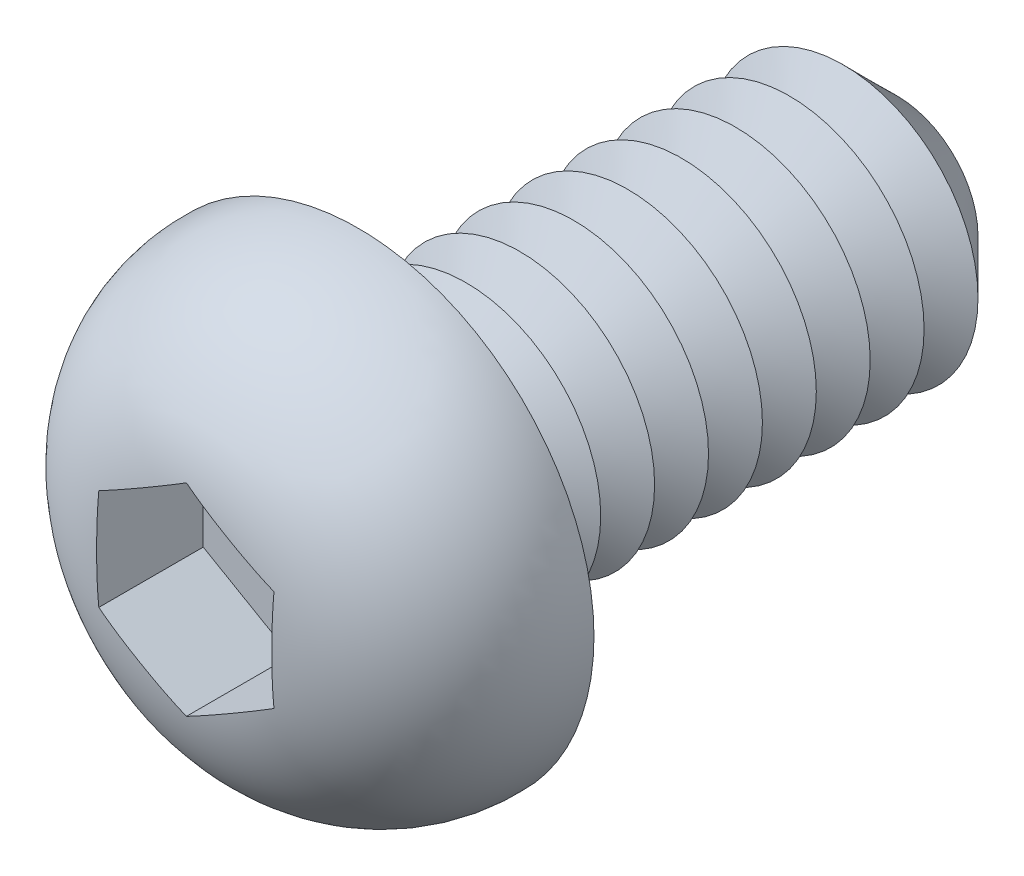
ISO-10303-21;
HEADER;
FILE_DESCRIPTION(('STEP AP214'),'2;1');
FILE_NAME('part.step','',(''),(''),'','','');
FILE_SCHEMA(('AUTOMOTIVE_DESIGN { 1 0 10303 214 1 1 1 1 }'));
ENDSEC;
DATA;
#1=APPLICATION_CONTEXT('core data for automotive mechanical design processes');
#2=APPLICATION_PROTOCOL_DEFINITION('international standard','automotive_design',2000,#1);
#3=PRODUCT_CONTEXT('',#1,'mechanical');
#4=PRODUCT('Part','Part','',(#3));
#5=PRODUCT_RELATED_PRODUCT_CATEGORY('part','',(#4));
#6=PRODUCT_DEFINITION_FORMATION('','',#4);
#7=PRODUCT_DEFINITION_CONTEXT('part definition',#1,'design');
#8=PRODUCT_DEFINITION('design','',#6,#7);
#9=PRODUCT_DEFINITION_SHAPE('','',#8);
#10=(LENGTH_UNIT() NAMED_UNIT(*) SI_UNIT(.MILLI.,.METRE.));
#11=(NAMED_UNIT(*) PLANE_ANGLE_UNIT() SI_UNIT($,.RADIAN.));
#12=(NAMED_UNIT(*) SI_UNIT($,.STERADIAN.) SOLID_ANGLE_UNIT());
#13=UNCERTAINTY_MEASURE_WITH_UNIT(LENGTH_MEASURE(1.E-05),#10,'distance_accuracy_value','');
#14=(GEOMETRIC_REPRESENTATION_CONTEXT(3) GLOBAL_UNCERTAINTY_ASSIGNED_CONTEXT((#13)) GLOBAL_UNIT_ASSIGNED_CONTEXT((#10,
#11,#12)) REPRESENTATION_CONTEXT('',''));
#15=CARTESIAN_POINT('',(0.,0.,0.));
#16=DIRECTION('',(0.,0.,1.));
#17=DIRECTION('',(1.,0.,0.));
#18=AXIS2_PLACEMENT_3D('',#15,#16,#17);
#19=CARTESIAN_POINT('',(0.,0.,-4.));
#20=DIRECTION('',(0.,0.,1.));
#21=DIRECTION('',(1.,0.,0.));
#22=AXIS2_PLACEMENT_3D('',#19,#20,#21);
#23=CYLINDRICAL_SURFACE('',#22,1.);
#24=CARTESIAN_POINT('',(0.,0.,-0.2));
#25=DIRECTION('',(0.,0.,1.));
#26=DIRECTION('',(1.,0.,0.));
#27=AXIS2_PLACEMENT_3D('',#24,#25,#26);
#28=CIRCLE('',#27,1.);
#29=CARTESIAN_POINT('',(1.,0.,-0.2));
#30=VERTEX_POINT('',#29);
#31=EDGE_CURVE('E48',#30,#30,#28,.F.);
#32=ORIENTED_EDGE('',*,*,#31,.T.);
#33=EDGE_LOOP('',(#32));
#34=FACE_BOUND('',#33,.T.);
#35=CARTESIAN_POINT('',(0.,0.,-0.399999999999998));
#36=DIRECTION('',(0.,0.,1.));
#37=DIRECTION('',(1.,0.,0.));
#38=AXIS2_PLACEMENT_3D('',#35,#36,#37);
#39=CIRCLE('',#38,1.);
#40=CARTESIAN_POINT('',(1.,0.,-0.399999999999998));
#41=VERTEX_POINT('',#40);
#42=EDGE_CURVE('E118',#41,#41,#39,.T.);
#43=ORIENTED_EDGE('',*,*,#42,.T.);
#44=EDGE_LOOP('',(#43));
#45=FACE_BOUND('',#44,.T.);
#46=ADVANCED_FACE('F39',(#34,#45),#23,.T.);
#47=CARTESIAN_POINT('',(0.,1.75,0.));
#48=DIRECTION('',(0.,0.,1.));
#49=DIRECTION('',(1.,0.,0.));
#50=AXIS2_PLACEMENT_3D('',#47,#48,#49);
#51=PLANE('',#50);
#52=CARTESIAN_POINT('',(0.,0.,0.));
#53=DIRECTION('',(0.,0.,1.));
#54=DIRECTION('',(1.,0.,0.));
#55=AXIS2_PLACEMENT_3D('',#52,#53,#54);
#56=CIRCLE('',#55,1.2);
#57=CARTESIAN_POINT('',(1.2,0.,0.));
#58=VERTEX_POINT('',#57);
#59=EDGE_CURVE('E11',#58,#58,#56,.T.);
#60=ORIENTED_EDGE('',*,*,#59,.T.);
#61=EDGE_LOOP('',(#60));
#62=FACE_BOUND('',#61,.T.);
#63=CARTESIAN_POINT('',(0.,0.,0.));
#64=DIRECTION('',(0.,0.,1.));
#65=DIRECTION('',(1.,0.,0.));
#66=AXIS2_PLACEMENT_3D('',#63,#64,#65);
#67=CIRCLE('',#66,1.75);
#68=CARTESIAN_POINT('',(1.75,0.,0.));
#69=VERTEX_POINT('',#68);
#70=EDGE_CURVE('E142',#69,#69,#67,.T.);
#71=ORIENTED_EDGE('',*,*,#70,.F.);
#72=EDGE_LOOP('',(#71));
#73=FACE_BOUND('',#72,.T.);
#74=ADVANCED_FACE('F218',(#62,#73),#51,.F.);
#75=CARTESIAN_POINT('',(0.,0.,0.0499999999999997));
#76=DIRECTION('',(0.,0.,1.));
#77=DIRECTION('',(1.,0.,0.));
#78=AXIS2_PLACEMENT_3D('',#75,#76,#77);
#79=DEGENERATE_TOROIDAL_SURFACE('',#78,0.50100040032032,1.25,.T.);
#80=CARTESIAN_POINT('',(-0.6502,0.375162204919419,1.2748120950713));
#81=CARTESIAN_POINT('',(-0.623166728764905,0.390769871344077,1.27799168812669));
#82=CARTESIAN_POINT('',(-0.596087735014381,0.406403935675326,1.28057383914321));
#83=CARTESIAN_POINT('',(-0.541883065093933,0.437699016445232,1.28476453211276));
#84=CARTESIAN_POINT('',(-0.514757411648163,0.453360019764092,1.28637345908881));
#85=CARTESIAN_POINT('',(-0.460533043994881,0.484666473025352,1.288838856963));
#86=CARTESIAN_POINT('',(-0.433434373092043,0.500311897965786,1.28969671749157));
#87=CARTESIAN_POINT('',(-0.379223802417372,0.531610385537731,1.29082127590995));
#88=CARTESIAN_POINT('',(-0.352111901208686,0.547263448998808,1.29108787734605));
#89=CARTESIAN_POINT('',(-0.297888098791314,0.578569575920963,1.29108787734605));
#90=CARTESIAN_POINT('',(-0.270776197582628,0.59422263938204,1.29082127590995));
#91=CARTESIAN_POINT('',(-0.216565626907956,0.625521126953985,1.28969671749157));
#92=CARTESIAN_POINT('',(-0.189466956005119,0.641166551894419,1.288838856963));
#93=CARTESIAN_POINT('',(-0.135242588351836,0.672473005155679,1.28637345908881));
#94=CARTESIAN_POINT('',(-0.108116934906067,0.688134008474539,1.28476453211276));
#95=CARTESIAN_POINT('',(-0.0539122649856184,0.719429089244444,1.28057383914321));
#96=CARTESIAN_POINT('',(-0.0268332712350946,0.735063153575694,1.27799168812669));
#97=CARTESIAN_POINT('',(0.000200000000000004,0.750670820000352,1.2748120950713));
#98=B_SPLINE_CURVE_WITH_KNOTS('',3,(#80,#81,#82,#83,#84,#85,#86,#87,#88,#89,#90,#91,#92,#93,#94,
#95,#96,#97),.UNSPECIFIED.,.F.,.F.,(4,2,2,2,2,2,2,2,4),(0.,0.0941133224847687,0.188189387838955,
0.282091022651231,0.376007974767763,0.469924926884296,0.563826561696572,0.657902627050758,
0.752015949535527),.UNSPECIFIED.);
#99=CARTESIAN_POINT('',(-0.65,0.375277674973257,1.27483563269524));
#100=VERTEX_POINT('',#99);
#101=CARTESIAN_POINT('',(0.,0.750555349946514,1.27483563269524));
#102=VERTEX_POINT('',#101);
#103=EDGE_CURVE('E159',#100,#102,#98,.T.);
#104=ORIENTED_EDGE('',*,*,#103,.T.);
#105=CARTESIAN_POINT('',(-0.000199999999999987,0.750670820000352,1.2748120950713));
#106=CARTESIAN_POINT('',(0.0268332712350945,0.735063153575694,1.27799168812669));
#107=CARTESIAN_POINT('',(0.0539122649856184,0.719429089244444,1.28057383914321));
#108=CARTESIAN_POINT('',(0.108116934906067,0.688134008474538,1.28476453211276));
#109=CARTESIAN_POINT('',(0.135242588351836,0.672473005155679,1.28637345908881));
#110=CARTESIAN_POINT('',(0.189466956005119,0.641166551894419,1.288838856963));
#111=CARTESIAN_POINT('',(0.216565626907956,0.625521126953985,1.28969671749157));
#112=CARTESIAN_POINT('',(0.270776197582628,0.59422263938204,1.29082127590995));
#113=CARTESIAN_POINT('',(0.297888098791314,0.578569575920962,1.29108787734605));
#114=CARTESIAN_POINT('',(0.352111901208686,0.547263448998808,1.29108787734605));
#115=CARTESIAN_POINT('',(0.379223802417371,0.531610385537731,1.29082127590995));
#116=CARTESIAN_POINT('',(0.433434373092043,0.500311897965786,1.28969671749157));
#117=CARTESIAN_POINT('',(0.46053304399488,0.484666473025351,1.288838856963));
#118=CARTESIAN_POINT('',(0.514757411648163,0.453360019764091,1.28637345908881));
#119=CARTESIAN_POINT('',(0.541883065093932,0.437699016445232,1.28476453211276));
#120=CARTESIAN_POINT('',(0.596087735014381,0.406403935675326,1.28057383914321));
#121=CARTESIAN_POINT('',(0.623166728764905,0.390769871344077,1.27799168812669));
#122=CARTESIAN_POINT('',(0.6502,0.375162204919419,1.2748120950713));
#123=B_SPLINE_CURVE_WITH_KNOTS('',3,(#105,#106,#107,#108,#109,#110,#111,#112,#113,#114,#115,
#116,#117,#118,#119,#120,#121,#122),.UNSPECIFIED.,.F.,.F.,(4,2,2,2,2,2,2,2,4),(0.,
0.0941133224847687,0.188189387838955,0.282091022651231,0.376007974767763,0.469924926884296,
0.563826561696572,0.657902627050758,0.752015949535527),.UNSPECIFIED.);
#124=CARTESIAN_POINT('',(0.65,0.375277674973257,1.27483563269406));
#125=VERTEX_POINT('',#124);
#126=EDGE_CURVE('E98',#102,#125,#123,.T.);
#127=ORIENTED_EDGE('',*,*,#126,.T.);
#128=CARTESIAN_POINT('',(0.65,0.,1.29108787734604));
#129=CARTESIAN_POINT('',(0.65,-0.0548046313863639,1.29109436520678));
#130=CARTESIAN_POINT('',(0.65,-0.109608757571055,1.29030350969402));
#131=CARTESIAN_POINT('',(0.65,-0.219170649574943,1.28661520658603));
#132=CARTESIAN_POINT('',(0.65,-0.273928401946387,1.28371727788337));
#133=CARTESIAN_POINT('',(0.65,-0.383095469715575,1.27460340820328));
#134=CARTESIAN_POINT('',(0.65,-0.437505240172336,1.26839356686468));
#135=CARTESIAN_POINT('',(0.65,-0.545599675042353,1.25147686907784));
#136=CARTESIAN_POINT('',(0.65,-0.599284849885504,1.24077336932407));
#137=CARTESIAN_POINT('',(0.65,-0.726147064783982,1.20871234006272));
#138=CARTESIAN_POINT('',(0.65,-0.79872007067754,1.18482363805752));
#139=CARTESIAN_POINT('',(0.65,-0.939044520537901,1.12544321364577));
#140=CARTESIAN_POINT('',(0.65,-1.00679500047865,1.08994917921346));
#141=CARTESIAN_POINT('',(0.65,-1.13535055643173,1.00723279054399));
#142=CARTESIAN_POINT('',(0.65,-1.19611172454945,0.959941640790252));
#143=CARTESIAN_POINT('',(0.65,-1.30775435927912,0.854818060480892));
#144=CARTESIAN_POINT('',(0.65,-1.35863681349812,0.796986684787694));
#145=CARTESIAN_POINT('',(0.65,-1.44408820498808,0.678594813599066));
#146=CARTESIAN_POINT('',(0.65,-1.4797502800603,0.618820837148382));
#147=CARTESIAN_POINT('',(0.65,-1.53998909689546,0.493937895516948));
#148=CARTESIAN_POINT('',(0.65,-1.56457069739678,0.428831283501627));
#149=CARTESIAN_POINT('',(0.65,-1.60096350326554,0.298259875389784));
#150=CARTESIAN_POINT('',(0.65,-1.61329238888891,0.232938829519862));
#151=CARTESIAN_POINT('',(0.65,-1.62664623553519,0.101147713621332));
#152=CARTESIAN_POINT('',(0.65,-1.6276715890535,0.0346776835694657));
#153=CARTESIAN_POINT('',(0.65,-1.6184464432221,-0.0965779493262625));
#154=CARTESIAN_POINT('',(0.65,-1.60834630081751,-0.161374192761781));
#155=CARTESIAN_POINT('',(0.65,-1.57743533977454,-0.288341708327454));
#156=CARTESIAN_POINT('',(0.65,-1.55662692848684,-0.350513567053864));
#157=CARTESIAN_POINT('',(0.65,-1.50490327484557,-0.470651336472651));
#158=CARTESIAN_POINT('',(0.65,-1.47396668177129,-0.528608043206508));
#159=CARTESIAN_POINT('',(0.65,-1.40295285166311,-0.63865943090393));
#160=CARTESIAN_POINT('',(0.65,-1.36286988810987,-0.690750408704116));
#161=CARTESIAN_POINT('',(0.65,-1.27395593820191,-0.788697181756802));
#162=CARTESIAN_POINT('',(0.65,-1.22497034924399,-0.834412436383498));
#163=CARTESIAN_POINT('',(0.65,-1.12042496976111,-0.917345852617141));
#164=CARTESIAN_POINT('',(0.65,-1.06487498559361,-0.954576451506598));
#165=CARTESIAN_POINT('',(0.65,-0.945822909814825,-1.02180899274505));
#166=CARTESIAN_POINT('',(0.65,-0.882060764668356,-1.05135028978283));
#167=CARTESIAN_POINT('',(0.65,-0.783687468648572,-1.08845195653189));
#168=CARTESIAN_POINT('',(0.65,-0.750379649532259,-1.09963089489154));
#169=CARTESIAN_POINT('',(0.65,-0.683093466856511,-1.11968224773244));
#170=CARTESIAN_POINT('',(0.65,-0.64911549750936,-1.12855597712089));
#171=CARTESIAN_POINT('',(0.65,-0.573025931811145,-1.14591124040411));
#172=CARTESIAN_POINT('',(0.65,-0.530794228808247,-1.15386155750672));
#173=CARTESIAN_POINT('',(0.65,-0.445896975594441,-1.16700727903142));
#174=CARTESIAN_POINT('',(0.65,-0.40323122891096,-1.17220137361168));
#175=CARTESIAN_POINT('',(0.65,-0.317562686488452,-1.18041063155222));
#176=CARTESIAN_POINT('',(0.65,-0.274559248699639,-1.18341875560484));
#177=CARTESIAN_POINT('',(0.65,-0.188468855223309,-1.18783962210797));
#178=CARTESIAN_POINT('',(0.65,-0.145381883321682,-1.1892520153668));
#179=CARTESIAN_POINT('',(0.65,-0.0590019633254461,-1.19095450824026));
#180=CARTESIAN_POINT('',(0.65,-0.0157089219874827,-1.19123978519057));
#181=CARTESIAN_POINT('',(0.65,0.0708684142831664,-1.1907952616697));
#182=CARTESIAN_POINT('',(0.65,0.114152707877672,-1.19006535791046));
#183=CARTESIAN_POINT('',(0.65,0.243756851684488,-1.18593769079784));
#184=CARTESIAN_POINT('',(0.65,0.330069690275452,-1.18060873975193));
#185=CARTESIAN_POINT('',(0.65,0.455654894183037,-1.16558903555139));
#186=CARTESIAN_POINT('',(0.65,0.495371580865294,-1.1597609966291));
#187=CARTESIAN_POINT('',(0.65,0.574346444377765,-1.14554740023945));
#188=CARTESIAN_POINT('',(0.65,0.613604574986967,-1.13716158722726));
#189=CARTESIAN_POINT('',(0.65,0.729813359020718,-1.10777161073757));
#190=CARTESIAN_POINT('',(0.65,0.805761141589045,-1.0824785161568));
#191=CARTESIAN_POINT('',(0.65,0.953092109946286,-1.01876094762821));
#192=CARTESIAN_POINT('',(0.65,1.02440985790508,-0.980183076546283));
#193=CARTESIAN_POINT('',(0.65,1.15871394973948,-0.890064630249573));
#194=CARTESIAN_POINT('',(0.65,1.22167627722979,-0.838487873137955));
#195=CARTESIAN_POINT('',(0.65,1.330165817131,-0.729868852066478));
#196=CARTESIAN_POINT('',(0.649999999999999,1.37682604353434,-0.673955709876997));
#197=CARTESIAN_POINT('',(0.649999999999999,1.45915796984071,-0.554638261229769));
#198=CARTESIAN_POINT('',(0.649999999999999,1.49484555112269,-0.491244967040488));
#199=CARTESIAN_POINT('',(0.649999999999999,1.55177809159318,-0.363813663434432));
#200=CARTESIAN_POINT('',(0.649999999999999,1.57388655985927,-0.300159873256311));
#201=CARTESIAN_POINT('',(0.649999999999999,1.60682450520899,-0.169982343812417));
#202=CARTESIAN_POINT('',(0.649999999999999,1.61765327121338,-0.103458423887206));
#203=CARTESIAN_POINT('',(0.649999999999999,1.62754441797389,0.0288862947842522));
#204=CARTESIAN_POINT('',(0.649999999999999,1.6268761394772,0.0946871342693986));
#205=CARTESIAN_POINT('',(0.649999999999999,1.61445465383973,0.225228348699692));
#206=CARTESIAN_POINT('',(0.649999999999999,1.60270257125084,0.289968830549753));
#207=CARTESIAN_POINT('',(0.649999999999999,1.56855547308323,0.416311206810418));
#208=CARTESIAN_POINT('',(0.649999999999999,1.54620091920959,0.477924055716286));
#209=CARTESIAN_POINT('',(0.649999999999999,1.49157336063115,0.596573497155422));
#210=CARTESIAN_POINT('',(0.649999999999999,1.459300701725,0.6536102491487));
#211=CARTESIAN_POINT('',(0.649999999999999,1.38544036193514,0.762206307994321));
#212=CARTESIAN_POINT('',(0.65,1.34375441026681,0.813698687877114));
#213=CARTESIAN_POINT('',(0.65,1.25257593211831,0.909229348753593));
#214=CARTESIAN_POINT('',(0.65,1.20308164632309,0.953265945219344));
#215=CARTESIAN_POINT('',(0.65,1.09600377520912,1.03435686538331));
#216=CARTESIAN_POINT('',(0.65,1.0382019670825,1.07112203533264));
#217=CARTESIAN_POINT('',(0.65,0.917680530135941,1.13527918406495));
#218=CARTESIAN_POINT('',(0.65,0.854963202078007,1.16267551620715));
#219=CARTESIAN_POINT('',(0.65,0.743153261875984,1.20242953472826));
#220=CARTESIAN_POINT('',(0.65,0.69477028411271,1.21684578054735));
#221=CARTESIAN_POINT('',(0.65,0.596867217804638,1.24115086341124));
#222=CARTESIAN_POINT('',(0.65,0.547346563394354,1.25103739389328));
#223=CARTESIAN_POINT('',(0.65,0.397729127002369,1.27492295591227));
#224=CARTESIAN_POINT('',(0.65,0.296733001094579,1.28309757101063));
#225=CARTESIAN_POINT('',(0.65,0.163130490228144,1.28863783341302));
#226=CARTESIAN_POINT('',(0.65,0.130510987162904,1.28957449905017));
#227=CARTESIAN_POINT('',(0.65,0.0652609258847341,1.29079749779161));
#228=CARTESIAN_POINT('',(0.65,0.0326303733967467,1.29108401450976));
#229=CARTESIAN_POINT('',(0.65,0.,1.29108787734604));
#230=B_SPLINE_CURVE_WITH_KNOTS('',3,(#128,#129,#130,#131,#132,#133,#134,#135,#136,#137,#138,
#139,#140,#141,#142,#143,#144,#145,#146,#147,#148,#149,#150,#151,#152,#153,#154,#155,#156,#157,
#158,#159,#160,#161,#162,#163,#164,#165,#166,#167,#168,#169,#170,#171,#172,#173,#174,#175,#176,
#177,#178,#179,#180,#181,#182,#183,#184,#185,#186,#187,#188,#189,#190,#191,#192,#193,#194,#195,
#196,#197,#198,#199,#200,#201,#202,#203,#204,#205,#206,#207,#208,#209,#210,#211,#212,#213,#214,
#215,#216,#217,#218,#219,#220,#221,#222,#223,#224,#225,#226,#227,#228,#229),.UNSPECIFIED.,.T.,
.F.,(4,2,2,2,2,2,2,2,2,2,2,2,2,2,2,2,2,2,2,2,2,2,2,2,2,2,2,2,2,2,2,2,2,2,2,2,2,2,2,2,2,2,2,2,2,
2,2,2,2,2,4),(0.,0.164404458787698,0.328846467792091,0.492986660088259,0.657004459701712,
0.885283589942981,1.11360822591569,1.34329681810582,1.57296243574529,1.78072081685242,
1.9883880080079,2.18685176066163,2.38530862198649,2.58111595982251,2.77687929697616,
2.97305799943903,3.16935986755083,3.36946935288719,3.5692835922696,3.77920028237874,
3.88453412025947,3.98980774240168,4.11861722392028,4.24748786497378,4.37677168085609,
4.50608378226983,4.63594858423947,4.76582660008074,5.02485743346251,5.14520715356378,
5.26556890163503,5.5046106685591,5.74651068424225,5.98909160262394,6.20640136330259,
6.42339510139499,6.62456294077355,6.82574346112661,7.02221748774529,7.21867158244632,
7.41438191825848,7.61008543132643,7.80793510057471,8.00582941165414,8.21046898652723,
8.41501334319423,8.56624321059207,8.71754999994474,9.02064941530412,9.11856257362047,
9.21644807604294),.UNSPECIFIED.);
#231=CARTESIAN_POINT('',(0.65,-0.375277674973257,1.27483563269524));
#232=VERTEX_POINT('',#231);
#233=EDGE_CURVE('E63',#125,#232,#230,.T.);
#234=ORIENTED_EDGE('',*,*,#233,.T.);
#235=CARTESIAN_POINT('',(0.6502,-0.375162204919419,1.2748120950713));
#236=CARTESIAN_POINT('',(0.623166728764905,-0.390769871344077,1.27799168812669));
#237=CARTESIAN_POINT('',(0.596087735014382,-0.406403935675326,1.28057383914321));
#238=CARTESIAN_POINT('',(0.541883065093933,-0.437699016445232,1.28476453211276));
#239=CARTESIAN_POINT('',(0.514757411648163,-0.453360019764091,1.28637345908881));
#240=CARTESIAN_POINT('',(0.460533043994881,-0.484666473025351,1.288838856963));
#241=CARTESIAN_POINT('',(0.433434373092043,-0.500311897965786,1.28969671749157));
#242=CARTESIAN_POINT('',(0.379223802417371,-0.531610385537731,1.29082127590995));
#243=CARTESIAN_POINT('',(0.352111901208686,-0.547263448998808,1.29108787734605));
#244=CARTESIAN_POINT('',(0.297888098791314,-0.578569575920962,1.29108787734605));
#245=CARTESIAN_POINT('',(0.270776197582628,-0.59422263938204,1.29082127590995));
#246=CARTESIAN_POINT('',(0.216565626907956,-0.625521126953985,1.28969671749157));
#247=CARTESIAN_POINT('',(0.189466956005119,-0.641166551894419,1.288838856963));
#248=CARTESIAN_POINT('',(0.135242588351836,-0.672473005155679,1.28637345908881));
#249=CARTESIAN_POINT('',(0.108116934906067,-0.688134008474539,1.28476453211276));
#250=CARTESIAN_POINT('',(0.0539122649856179,-0.719429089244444,1.28057383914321));
#251=CARTESIAN_POINT('',(0.026833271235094,-0.735063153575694,1.27799168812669));
#252=CARTESIAN_POINT('',(-0.000200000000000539,-0.750670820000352,1.2748120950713));
#253=B_SPLINE_CURVE_WITH_KNOTS('',3,(#235,#236,#237,#238,#239,#240,#241,#242,#243,#244,#245,
#246,#247,#248,#249,#250,#251,#252),.UNSPECIFIED.,.F.,.F.,(4,2,2,2,2,2,2,2,4),(0.,
0.0941133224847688,0.188189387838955,0.282091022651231,0.376007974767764,0.469924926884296,
0.563826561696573,0.657902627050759,0.752015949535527),.UNSPECIFIED.);
#254=CARTESIAN_POINT('',(0.,-0.750555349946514,1.27483563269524));
#255=VERTEX_POINT('',#254);
#256=EDGE_CURVE('E239',#232,#255,#253,.T.);
#257=ORIENTED_EDGE('',*,*,#256,.T.);
#258=CARTESIAN_POINT('',(0.000199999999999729,-0.750670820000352,1.2748120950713));
#259=CARTESIAN_POINT('',(-0.0268332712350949,-0.735063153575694,1.27799168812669));
#260=CARTESIAN_POINT('',(-0.0539122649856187,-0.719429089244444,1.28057383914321));
#261=CARTESIAN_POINT('',(-0.108116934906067,-0.688134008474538,1.28476453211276));
#262=CARTESIAN_POINT('',(-0.135242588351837,-0.672473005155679,1.28637345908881));
#263=CARTESIAN_POINT('',(-0.18946695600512,-0.641166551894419,1.288838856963));
#264=CARTESIAN_POINT('',(-0.216565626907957,-0.625521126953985,1.28969671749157));
#265=CARTESIAN_POINT('',(-0.270776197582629,-0.59422263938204,1.29082127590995));
#266=CARTESIAN_POINT('',(-0.297888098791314,-0.578569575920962,1.29108787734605));
#267=CARTESIAN_POINT('',(-0.352111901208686,-0.547263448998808,1.29108787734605));
#268=CARTESIAN_POINT('',(-0.379223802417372,-0.531610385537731,1.29082127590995));
#269=CARTESIAN_POINT('',(-0.433434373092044,-0.500311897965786,1.28969671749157));
#270=CARTESIAN_POINT('',(-0.460533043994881,-0.484666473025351,1.288838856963));
#271=CARTESIAN_POINT('',(-0.514757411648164,-0.453360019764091,1.28637345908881));
#272=CARTESIAN_POINT('',(-0.541883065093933,-0.437699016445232,1.28476453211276));
#273=CARTESIAN_POINT('',(-0.596087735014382,-0.406403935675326,1.28057383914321));
#274=CARTESIAN_POINT('',(-0.623166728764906,-0.390769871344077,1.27799168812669));
#275=CARTESIAN_POINT('',(-0.6502,-0.375162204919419,1.2748120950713));
#276=B_SPLINE_CURVE_WITH_KNOTS('',3,(#258,#259,#260,#261,#262,#263,#264,#265,#266,#267,#268,
#269,#270,#271,#272,#273,#274,#275),.UNSPECIFIED.,.F.,.F.,(4,2,2,2,2,2,2,2,4),(0.,
0.0941133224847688,0.188189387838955,0.282091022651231,0.376007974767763,0.469924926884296,
0.563826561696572,0.657902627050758,0.752015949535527),.UNSPECIFIED.);
#277=CARTESIAN_POINT('',(-0.65,-0.375277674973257,1.27483563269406));
#278=VERTEX_POINT('',#277);
#279=EDGE_CURVE('E245',#255,#278,#276,.T.);
#280=ORIENTED_EDGE('',*,*,#279,.T.);
#281=CARTESIAN_POINT('',(-0.65,0.,1.29108787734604));
#282=CARTESIAN_POINT('',(-0.65,0.0548046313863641,1.29109436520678));
#283=CARTESIAN_POINT('',(-0.65,0.109608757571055,1.29030350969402));
#284=CARTESIAN_POINT('',(-0.65,0.219170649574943,1.28661520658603));
#285=CARTESIAN_POINT('',(-0.65,0.273928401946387,1.28371727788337));
#286=CARTESIAN_POINT('',(-0.65,0.383095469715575,1.27460340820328));
#287=CARTESIAN_POINT('',(-0.65,0.437505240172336,1.26839356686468));
#288=CARTESIAN_POINT('',(-0.65,0.545599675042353,1.25147686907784));
#289=CARTESIAN_POINT('',(-0.65,0.599284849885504,1.24077336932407));
#290=CARTESIAN_POINT('',(-0.65,0.726147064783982,1.20871234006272));
#291=CARTESIAN_POINT('',(-0.65,0.79872007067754,1.18482363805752));
#292=CARTESIAN_POINT('',(-0.65,0.939044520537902,1.12544321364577));
#293=CARTESIAN_POINT('',(-0.65,1.00679500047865,1.08994917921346));
#294=CARTESIAN_POINT('',(-0.65,1.13535055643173,1.00723279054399));
#295=CARTESIAN_POINT('',(-0.65,1.19611172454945,0.959941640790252));
#296=CARTESIAN_POINT('',(-0.65,1.30775435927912,0.854818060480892));
#297=CARTESIAN_POINT('',(-0.649999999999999,1.35863681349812,0.796986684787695));
#298=CARTESIAN_POINT('',(-0.649999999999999,1.44408820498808,0.678594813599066));
#299=CARTESIAN_POINT('',(-0.649999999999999,1.4797502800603,0.618820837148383));
#300=CARTESIAN_POINT('',(-0.649999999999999,1.53998909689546,0.493937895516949));
#301=CARTESIAN_POINT('',(-0.649999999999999,1.56457069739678,0.428831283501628));
#302=CARTESIAN_POINT('',(-0.649999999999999,1.60096350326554,0.298259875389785));
#303=CARTESIAN_POINT('',(-0.649999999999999,1.61329238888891,0.232938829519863));
#304=CARTESIAN_POINT('',(-0.649999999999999,1.62664623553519,0.101147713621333));
#305=CARTESIAN_POINT('',(-0.649999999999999,1.6276715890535,0.0346776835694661));
#306=CARTESIAN_POINT('',(-0.649999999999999,1.6184464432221,-0.0965779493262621));
#307=CARTESIAN_POINT('',(-0.649999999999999,1.60834630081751,-0.16137419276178));
#308=CARTESIAN_POINT('',(-0.649999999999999,1.57743533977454,-0.288341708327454));
#309=CARTESIAN_POINT('',(-0.649999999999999,1.55662692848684,-0.350513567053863));
#310=CARTESIAN_POINT('',(-0.649999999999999,1.50490327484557,-0.47065133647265));
#311=CARTESIAN_POINT('',(-0.649999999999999,1.47396668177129,-0.528608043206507));
#312=CARTESIAN_POINT('',(-0.649999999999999,1.40295285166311,-0.638659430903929));
#313=CARTESIAN_POINT('',(-0.649999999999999,1.36286988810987,-0.690750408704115));
#314=CARTESIAN_POINT('',(-0.649999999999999,1.27395593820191,-0.788697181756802));
#315=CARTESIAN_POINT('',(-0.65,1.22497034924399,-0.834412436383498));
#316=CARTESIAN_POINT('',(-0.65,1.12042496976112,-0.91734585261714));
#317=CARTESIAN_POINT('',(-0.65,1.06487498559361,-0.954576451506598));
#318=CARTESIAN_POINT('',(-0.65,0.945822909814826,-1.02180899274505));
#319=CARTESIAN_POINT('',(-0.65,0.882060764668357,-1.05135028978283));
#320=CARTESIAN_POINT('',(-0.65,0.783687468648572,-1.08845195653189));
#321=CARTESIAN_POINT('',(-0.65,0.75037964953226,-1.09963089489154));
#322=CARTESIAN_POINT('',(-0.65,0.683093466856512,-1.11968224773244));
#323=CARTESIAN_POINT('',(-0.65,0.649115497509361,-1.12855597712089));
#324=CARTESIAN_POINT('',(-0.65,0.573025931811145,-1.14591124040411));
#325=CARTESIAN_POINT('',(-0.65,0.530794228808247,-1.15386155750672));
#326=CARTESIAN_POINT('',(-0.65,0.445896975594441,-1.16700727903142));
#327=CARTESIAN_POINT('',(-0.65,0.40323122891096,-1.17220137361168));
#328=CARTESIAN_POINT('',(-0.65,0.317562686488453,-1.18041063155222));
#329=CARTESIAN_POINT('',(-0.65,0.27455924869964,-1.18341875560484));
#330=CARTESIAN_POINT('',(-0.65,0.18846885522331,-1.18783962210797));
#331=CARTESIAN_POINT('',(-0.65,0.145381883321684,-1.1892520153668));
#332=CARTESIAN_POINT('',(-0.65,0.0590019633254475,-1.19095450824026));
#333=CARTESIAN_POINT('',(-0.65,0.0157089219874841,-1.19123978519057));
#334=CARTESIAN_POINT('',(-0.65,-0.070868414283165,-1.1907952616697));
#335=CARTESIAN_POINT('',(-0.65,-0.114152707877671,-1.19006535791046));
#336=CARTESIAN_POINT('',(-0.65,-0.243756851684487,-1.18593769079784));
#337=CARTESIAN_POINT('',(-0.65,-0.330069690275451,-1.18060873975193));
#338=CARTESIAN_POINT('',(-0.65,-0.455654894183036,-1.16558903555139));
#339=CARTESIAN_POINT('',(-0.65,-0.495371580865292,-1.1597609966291));
#340=CARTESIAN_POINT('',(-0.65,-0.574346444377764,-1.14554740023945));
#341=CARTESIAN_POINT('',(-0.65,-0.613604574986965,-1.13716158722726));
#342=CARTESIAN_POINT('',(-0.65,-0.729813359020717,-1.10777161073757));
#343=CARTESIAN_POINT('',(-0.65,-0.805761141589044,-1.0824785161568));
#344=CARTESIAN_POINT('',(-0.65,-0.953092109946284,-1.01876094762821));
#345=CARTESIAN_POINT('',(-0.65,-1.02440985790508,-0.980183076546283));
#346=CARTESIAN_POINT('',(-0.65,-1.15871394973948,-0.890064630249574));
#347=CARTESIAN_POINT('',(-0.65,-1.22167627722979,-0.838487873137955));
#348=CARTESIAN_POINT('',(-0.65,-1.330165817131,-0.729868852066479));
#349=CARTESIAN_POINT('',(-0.65,-1.37682604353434,-0.673955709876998));
#350=CARTESIAN_POINT('',(-0.65,-1.45915796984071,-0.55463826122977));
#351=CARTESIAN_POINT('',(-0.65,-1.49484555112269,-0.49124496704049));
#352=CARTESIAN_POINT('',(-0.65,-1.55177809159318,-0.363813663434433));
#353=CARTESIAN_POINT('',(-0.65,-1.57388655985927,-0.300159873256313));
#354=CARTESIAN_POINT('',(-0.65,-1.60682450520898,-0.169982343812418));
#355=CARTESIAN_POINT('',(-0.65,-1.61765327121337,-0.103458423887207));
#356=CARTESIAN_POINT('',(-0.65,-1.62754441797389,0.0288862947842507));
#357=CARTESIAN_POINT('',(-0.65,-1.6268761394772,0.0946871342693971));
#358=CARTESIAN_POINT('',(-0.65,-1.61445465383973,0.22522834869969));
#359=CARTESIAN_POINT('',(-0.65,-1.60270257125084,0.289968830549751));
#360=CARTESIAN_POINT('',(-0.65,-1.56855547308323,0.416311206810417));
#361=CARTESIAN_POINT('',(-0.65,-1.54620091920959,0.477924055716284));
#362=CARTESIAN_POINT('',(-0.65,-1.49157336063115,0.596573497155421));
#363=CARTESIAN_POINT('',(-0.65,-1.459300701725,0.653610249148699));
#364=CARTESIAN_POINT('',(-0.65,-1.38544036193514,0.762206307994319));
#365=CARTESIAN_POINT('',(-0.65,-1.34375441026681,0.813698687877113));
#366=CARTESIAN_POINT('',(-0.65,-1.25257593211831,0.909229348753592));
#367=CARTESIAN_POINT('',(-0.65,-1.20308164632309,0.953265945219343));
#368=CARTESIAN_POINT('',(-0.65,-1.09600377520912,1.03435686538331));
#369=CARTESIAN_POINT('',(-0.65,-1.0382019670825,1.07112203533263));
#370=CARTESIAN_POINT('',(-0.65,-0.917680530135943,1.13527918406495));
#371=CARTESIAN_POINT('',(-0.65,-0.854963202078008,1.16267551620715));
#372=CARTESIAN_POINT('',(-0.65,-0.743153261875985,1.20242953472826));
#373=CARTESIAN_POINT('',(-0.65,-0.694770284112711,1.21684578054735));
#374=CARTESIAN_POINT('',(-0.65,-0.596867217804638,1.24115086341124));
#375=CARTESIAN_POINT('',(-0.65,-0.547346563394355,1.25103739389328));
#376=CARTESIAN_POINT('',(-0.65,-0.39772912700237,1.27492295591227));
#377=CARTESIAN_POINT('',(-0.65,-0.296733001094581,1.28309757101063));
#378=CARTESIAN_POINT('',(-0.65,-0.163130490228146,1.28863783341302));
#379=CARTESIAN_POINT('',(-0.65,-0.130510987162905,1.28957449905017));
#380=CARTESIAN_POINT('',(-0.65,-0.0652609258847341,1.29079749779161));
#381=CARTESIAN_POINT('',(-0.65,-0.0326303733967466,1.29108401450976));
#382=CARTESIAN_POINT('',(-0.65,0.,1.29108787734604));
#383=B_SPLINE_CURVE_WITH_KNOTS('',3,(#281,#282,#283,#284,#285,#286,#287,#288,#289,#290,#291,
#292,#293,#294,#295,#296,#297,#298,#299,#300,#301,#302,#303,#304,#305,#306,#307,#308,#309,#310,
#311,#312,#313,#314,#315,#316,#317,#318,#319,#320,#321,#322,#323,#324,#325,#326,#327,#328,#329,
#330,#331,#332,#333,#334,#335,#336,#337,#338,#339,#340,#341,#342,#343,#344,#345,#346,#347,#348,
#349,#350,#351,#352,#353,#354,#355,#356,#357,#358,#359,#360,#361,#362,#363,#364,#365,#366,#367,
#368,#369,#370,#371,#372,#373,#374,#375,#376,#377,#378,#379,#380,#381,#382),.UNSPECIFIED.,.T.,
.F.,(4,2,2,2,2,2,2,2,2,2,2,2,2,2,2,2,2,2,2,2,2,2,2,2,2,2,2,2,2,2,2,2,2,2,2,2,2,2,2,2,2,2,2,2,2,
2,2,2,2,2,4),(0.,0.164404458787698,0.328846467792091,0.492986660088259,0.657004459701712,
0.885283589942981,1.11360822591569,1.34329681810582,1.57296243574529,1.78072081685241,
1.9883880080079,2.18685176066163,2.38530862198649,2.58111595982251,2.77687929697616,
2.97305799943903,3.16935986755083,3.36946935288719,3.5692835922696,3.77920028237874,
3.88453412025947,3.98980774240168,4.11861722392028,4.24748786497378,4.37677168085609,
4.50608378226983,4.63594858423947,4.76582660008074,5.02485743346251,5.14520715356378,
5.26556890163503,5.50461066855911,5.74651068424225,5.98909160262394,6.20640136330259,
6.42339510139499,6.62456294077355,6.82574346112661,7.02221748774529,7.21867158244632,
7.41438191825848,7.61008543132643,7.80793510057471,8.00582941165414,8.21046898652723,
8.41501334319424,8.56624321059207,8.71754999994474,9.02064941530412,9.11856257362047,
9.21644807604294),.UNSPECIFIED.);
#384=EDGE_CURVE('E167',#278,#100,#383,.T.);
#385=ORIENTED_EDGE('',*,*,#384,.T.);
#386=EDGE_LOOP('',(#104,#127,#234,#257,#280,#385));
#387=FACE_BOUND('',#386,.T.);
#388=ORIENTED_EDGE('',*,*,#70,.T.);
#389=EDGE_LOOP('',(#388));
#390=FACE_BOUND('',#389,.T.);
#391=ADVANCED_FACE('F172',(#387,#390),#79,.T.);
#392=CARTESIAN_POINT('',(0.65,0.375277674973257,0.5));
#393=DIRECTION('',(0.5,0.866025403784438,0.));
#394=DIRECTION('',(-0.866025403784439,0.5,0.));
#395=AXIS2_PLACEMENT_3D('',#392,#393,#394);
#396=PLANE('',#395);
#397=DIRECTION('',(0.,0.,1.));
#398=VECTOR('',#397,1.);
#399=CARTESIAN_POINT('',(0.,0.750555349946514,0.5));
#400=LINE('',#399,#398);
#401=CARTESIAN_POINT('',(0.,0.750555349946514,0.5));
#402=VERTEX_POINT('',#401);
#403=EDGE_CURVE('E55',#402,#102,#400,.T.);
#404=ORIENTED_EDGE('',*,*,#403,.F.);
#405=DIRECTION('',(-0.866025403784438,0.5,0.));
#406=VECTOR('',#405,1.);
#407=CARTESIAN_POINT('',(0.65,0.375277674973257,0.5));
#408=LINE('',#407,#406);
#409=CARTESIAN_POINT('',(0.65,0.375277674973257,0.5));
#410=VERTEX_POINT('',#409);
#411=EDGE_CURVE('E95',#410,#402,#408,.T.);
#412=ORIENTED_EDGE('',*,*,#411,.F.);
#413=DIRECTION('',(0.,0.,1.));
#414=VECTOR('',#413,1.);
#415=CARTESIAN_POINT('',(0.65,0.375277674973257,0.5));
#416=LINE('',#415,#414);
#417=EDGE_CURVE('E139',#410,#125,#416,.T.);
#418=ORIENTED_EDGE('',*,*,#417,.T.);
#419=ORIENTED_EDGE('',*,*,#126,.F.);
#420=EDGE_LOOP('',(#404,#412,#418,#419));
#421=FACE_BOUND('',#420,.T.);
#422=ADVANCED_FACE('F93',(#421),#396,.F.);
#423=CARTESIAN_POINT('',(0.65,-0.375277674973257,0.5));
#424=DIRECTION('',(1.,0.,0.));
#425=DIRECTION('',(0.,1.,0.));
#426=AXIS2_PLACEMENT_3D('',#423,#424,#425);
#427=PLANE('',#426);
#428=ORIENTED_EDGE('',*,*,#417,.F.);
#429=DIRECTION('',(0.,1.,0.));
#430=VECTOR('',#429,1.);
#431=CARTESIAN_POINT('',(0.65,-0.375277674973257,0.5));
#432=LINE('',#431,#430);
#433=CARTESIAN_POINT('',(0.65,-0.375277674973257,0.5));
#434=VERTEX_POINT('',#433);
#435=EDGE_CURVE('E102',#434,#410,#432,.T.);
#436=ORIENTED_EDGE('',*,*,#435,.F.);
#437=DIRECTION('',(0.,0.,1.));
#438=VECTOR('',#437,1.);
#439=CARTESIAN_POINT('',(0.65,-0.375277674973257,0.5));
#440=LINE('',#439,#438);
#441=EDGE_CURVE('E143',#434,#232,#440,.T.);
#442=ORIENTED_EDGE('',*,*,#441,.T.);
#443=ORIENTED_EDGE('',*,*,#233,.F.);
#444=EDGE_LOOP('',(#428,#436,#442,#443));
#445=FACE_BOUND('',#444,.T.);
#446=ADVANCED_FACE('F183',(#445),#427,.F.);
#447=CARTESIAN_POINT('',(0.,-0.750555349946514,0.5));
#448=DIRECTION('',(0.5,-0.866025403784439,0.));
#449=DIRECTION('',(0.866025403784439,0.5,0.));
#450=AXIS2_PLACEMENT_3D('',#447,#448,#449);
#451=PLANE('',#450);
#452=ORIENTED_EDGE('',*,*,#441,.F.);
#453=DIRECTION('',(0.866025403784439,0.5,0.));
#454=VECTOR('',#453,1.);
#455=CARTESIAN_POINT('',(0.,-0.750555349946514,0.5));
#456=LINE('',#455,#454);
#457=CARTESIAN_POINT('',(0.,-0.750555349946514,0.5));
#458=VERTEX_POINT('',#457);
#459=EDGE_CURVE('E134',#458,#434,#456,.T.);
#460=ORIENTED_EDGE('',*,*,#459,.F.);
#461=DIRECTION('',(0.,0.,1.));
#462=VECTOR('',#461,1.);
#463=CARTESIAN_POINT('',(0.,-0.750555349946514,0.5));
#464=LINE('',#463,#462);
#465=EDGE_CURVE('E146',#458,#255,#464,.T.);
#466=ORIENTED_EDGE('',*,*,#465,.T.);
#467=ORIENTED_EDGE('',*,*,#256,.F.);
#468=EDGE_LOOP('',(#452,#460,#466,#467));
#469=FACE_BOUND('',#468,.T.);
#470=ADVANCED_FACE('F233',(#469),#451,.F.);
#471=CARTESIAN_POINT('',(-0.65,-0.375277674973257,0.5));
#472=DIRECTION('',(-0.5,-0.866025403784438,0.));
#473=DIRECTION('',(0.866025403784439,-0.5,0.));
#474=AXIS2_PLACEMENT_3D('',#471,#472,#473);
#475=PLANE('',#474);
#476=ORIENTED_EDGE('',*,*,#465,.F.);
#477=DIRECTION('',(0.866025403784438,-0.5,0.));
#478=VECTOR('',#477,1.);
#479=CARTESIAN_POINT('',(-0.65,-0.375277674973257,0.5));
#480=LINE('',#479,#478);
#481=CARTESIAN_POINT('',(-0.65,-0.375277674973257,0.5));
#482=VERTEX_POINT('',#481);
#483=EDGE_CURVE('E130',#482,#458,#480,.T.);
#484=ORIENTED_EDGE('',*,*,#483,.F.);
#485=DIRECTION('',(0.,0.,1.));
#486=VECTOR('',#485,1.);
#487=CARTESIAN_POINT('',(-0.65,-0.375277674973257,0.5));
#488=LINE('',#487,#486);
#489=EDGE_CURVE('E150',#482,#278,#488,.T.);
#490=ORIENTED_EDGE('',*,*,#489,.T.);
#491=ORIENTED_EDGE('',*,*,#279,.F.);
#492=EDGE_LOOP('',(#476,#484,#490,#491));
#493=FACE_BOUND('',#492,.T.);
#494=ADVANCED_FACE('F236',(#493),#475,.F.);
#495=CARTESIAN_POINT('',(-0.65,0.375277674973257,0.5));
#496=DIRECTION('',(-1.,0.,0.));
#497=DIRECTION('',(0.,-1.,0.));
#498=AXIS2_PLACEMENT_3D('',#495,#496,#497);
#499=PLANE('',#498);
#500=ORIENTED_EDGE('',*,*,#489,.F.);
#501=DIRECTION('',(0.,-1.,0.));
#502=VECTOR('',#501,1.);
#503=CARTESIAN_POINT('',(-0.65,0.375277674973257,0.5));
#504=LINE('',#503,#502);
#505=CARTESIAN_POINT('',(-0.65,0.375277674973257,0.5));
#506=VERTEX_POINT('',#505);
#507=EDGE_CURVE('E112',#506,#482,#504,.T.);
#508=ORIENTED_EDGE('',*,*,#507,.F.);
#509=DIRECTION('',(0.,0.,1.));
#510=VECTOR('',#509,1.);
#511=CARTESIAN_POINT('',(-0.65,0.375277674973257,0.5));
#512=LINE('',#511,#510);
#513=EDGE_CURVE('E101',#506,#100,#512,.T.);
#514=ORIENTED_EDGE('',*,*,#513,.T.);
#515=ORIENTED_EDGE('',*,*,#384,.F.);
#516=EDGE_LOOP('',(#500,#508,#514,#515));
#517=FACE_BOUND('',#516,.T.);
#518=ADVANCED_FACE('F178',(#517),#499,.F.);
#519=CARTESIAN_POINT('',(0.,0.750555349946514,0.5));
#520=DIRECTION('',(-0.5,0.866025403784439,0.));
#521=DIRECTION('',(-0.866025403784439,-0.5,0.));
#522=AXIS2_PLACEMENT_3D('',#519,#520,#521);
#523=PLANE('',#522);
#524=ORIENTED_EDGE('',*,*,#513,.F.);
#525=DIRECTION('',(-0.866025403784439,-0.5,0.));
#526=VECTOR('',#525,1.);
#527=CARTESIAN_POINT('',(0.,0.750555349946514,0.5));
#528=LINE('',#527,#526);
#529=EDGE_CURVE('E105',#402,#506,#528,.T.);
#530=ORIENTED_EDGE('',*,*,#529,.F.);
#531=ORIENTED_EDGE('',*,*,#403,.T.);
#532=ORIENTED_EDGE('',*,*,#103,.F.);
#533=EDGE_LOOP('',(#524,#530,#531,#532));
#534=FACE_BOUND('',#533,.T.);
#535=ADVANCED_FACE('F106',(#534),#523,.F.);
#536=CARTESIAN_POINT('',(0.,0.,0.5));
#537=DIRECTION('',(0.,0.,1.));
#538=DIRECTION('',(1.,0.,0.));
#539=AXIS2_PLACEMENT_3D('',#536,#537,#538);
#540=PLANE('',#539);
#541=CARTESIAN_POINT('',(0.,0.,0.5));
#542=DIRECTION('',(0.,0.,1.));
#543=DIRECTION('',(1.,0.,0.));
#544=AXIS2_PLACEMENT_3D('',#541,#542,#543);
#545=CIRCLE('',#544,0.35);
#546=CARTESIAN_POINT('',(0.35,0.,0.5));
#547=VERTEX_POINT('',#546);
#548=EDGE_CURVE('E282',#547,#547,#545,.T.);
#549=ORIENTED_EDGE('',*,*,#548,.F.);
#550=EDGE_LOOP('',(#549));
#551=FACE_BOUND('',#550,.T.);
#552=ORIENTED_EDGE('',*,*,#411,.T.);
#553=ORIENTED_EDGE('',*,*,#529,.T.);
#554=ORIENTED_EDGE('',*,*,#507,.T.);
#555=ORIENTED_EDGE('',*,*,#483,.T.);
#556=ORIENTED_EDGE('',*,*,#459,.T.);
#557=ORIENTED_EDGE('',*,*,#435,.T.);
#558=EDGE_LOOP('',(#552,#553,#554,#555,#556,#557));
#559=FACE_BOUND('',#558,.T.);
#560=ADVANCED_FACE('F114',(#551,#559),#540,.T.);
#561=CARTESIAN_POINT('',(0.,0.,-0.399999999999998));
#562=DIRECTION('',(0.,0.,1.));
#563=DIRECTION('',(1.,0.,0.));
#564=AXIS2_PLACEMENT_3D('',#561,#562,#563);
#565=CONICAL_SURFACE('',#564,1.,1.04719755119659);
#566=CARTESIAN_POINT('',(0.,0.,-0.600000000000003));
#567=DIRECTION('',(0.,0.,1.));
#568=DIRECTION('',(1.,0.,0.));
#569=AXIS2_PLACEMENT_3D('',#566,#567,#568);
#570=CIRCLE('',#569,0.653589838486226);
#571=CARTESIAN_POINT('',(0.653589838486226,0.,-0.600000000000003));
#572=VERTEX_POINT('',#571);
#573=EDGE_CURVE('E124',#572,#572,#570,.T.);
#574=ORIENTED_EDGE('',*,*,#573,.T.);
#575=EDGE_LOOP('',(#574));
#576=FACE_BOUND('',#575,.T.);
#577=ORIENTED_EDGE('',*,*,#42,.F.);
#578=EDGE_LOOP('',(#577));
#579=FACE_BOUND('',#578,.T.);
#580=ADVANCED_FACE('F228',(#576,#579),#565,.T.);
#581=CARTESIAN_POINT('',(0.,0.,-0.600000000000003));
#582=DIRECTION('',(0.,0.,-1.));
#583=DIRECTION('',(-1.,0.,0.));
#584=AXIS2_PLACEMENT_3D('',#581,#582,#583);
#585=CONICAL_SURFACE('',#584,0.653589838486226,1.0471975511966);
#586=CARTESIAN_POINT('',(0.,0.,-0.799999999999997));
#587=DIRECTION('',(0.,0.,1.));
#588=DIRECTION('',(1.,0.,0.));
#589=AXIS2_PLACEMENT_3D('',#586,#587,#588);
#590=CIRCLE('',#589,1.);
#591=CARTESIAN_POINT('',(1.,0.,-0.799999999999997));
#592=VERTEX_POINT('',#591);
#593=EDGE_CURVE('E271',#592,#592,#590,.T.);
#594=ORIENTED_EDGE('',*,*,#593,.T.);
#595=EDGE_LOOP('',(#594));
#596=FACE_BOUND('',#595,.T.);
#597=ORIENTED_EDGE('',*,*,#573,.F.);
#598=EDGE_LOOP('',(#597));
#599=FACE_BOUND('',#598,.T.);
#600=ADVANCED_FACE('F334',(#596,#599),#585,.T.);
#601=CARTESIAN_POINT('',(0.,0.,-0.799999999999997));
#602=DIRECTION('',(0.,0.,1.));
#603=DIRECTION('',(1.,0.,0.));
#604=AXIS2_PLACEMENT_3D('',#601,#602,#603);
#605=CONICAL_SURFACE('',#604,1.,1.04719755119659);
#606=CARTESIAN_POINT('',(0.,0.,-1.));
#607=DIRECTION('',(0.,0.,1.));
#608=DIRECTION('',(1.,0.,0.));
#609=AXIS2_PLACEMENT_3D('',#606,#607,#608);
#610=CIRCLE('',#609,0.653589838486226);
#611=CARTESIAN_POINT('',(0.653589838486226,0.,-1.));
#612=VERTEX_POINT('',#611);
#613=EDGE_CURVE('E274',#612,#612,#610,.T.);
#614=ORIENTED_EDGE('',*,*,#613,.T.);
#615=EDGE_LOOP('',(#614));
#616=FACE_BOUND('',#615,.T.);
#617=ORIENTED_EDGE('',*,*,#593,.F.);
#618=EDGE_LOOP('',(#617));
#619=FACE_BOUND('',#618,.T.);
#620=ADVANCED_FACE('F336',(#616,#619),#605,.T.);
#621=CARTESIAN_POINT('',(0.,0.,-1.));
#622=DIRECTION('',(0.,0.,-1.));
#623=DIRECTION('',(-1.,0.,0.));
#624=AXIS2_PLACEMENT_3D('',#621,#622,#623);
#625=CONICAL_SURFACE('',#624,0.653589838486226,1.0471975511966);
#626=CARTESIAN_POINT('',(0.,0.,-1.2));
#627=DIRECTION('',(0.,0.,1.));
#628=DIRECTION('',(1.,0.,0.));
#629=AXIS2_PLACEMENT_3D('',#626,#627,#628);
#630=CIRCLE('',#629,1.);
#631=CARTESIAN_POINT('',(1.,0.,-1.2));
#632=VERTEX_POINT('',#631);
#633=EDGE_CURVE('E277',#632,#632,#630,.T.);
#634=ORIENTED_EDGE('',*,*,#633,.T.);
#635=EDGE_LOOP('',(#634));
#636=FACE_BOUND('',#635,.T.);
#637=ORIENTED_EDGE('',*,*,#613,.F.);
#638=EDGE_LOOP('',(#637));
#639=FACE_BOUND('',#638,.T.);
#640=ADVANCED_FACE('F343',(#636,#639),#625,.T.);
#641=CARTESIAN_POINT('',(0.,0.,-1.2));
#642=DIRECTION('',(0.,0.,1.));
#643=DIRECTION('',(1.,0.,0.));
#644=AXIS2_PLACEMENT_3D('',#641,#642,#643);
#645=CONICAL_SURFACE('',#644,1.,1.04719755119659);
#646=CARTESIAN_POINT('',(0.,0.,-1.4));
#647=DIRECTION('',(0.,0.,1.));
#648=DIRECTION('',(1.,0.,0.));
#649=AXIS2_PLACEMENT_3D('',#646,#647,#648);
#650=CIRCLE('',#649,0.653589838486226);
#651=CARTESIAN_POINT('',(0.653589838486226,0.,-1.4));
#652=VERTEX_POINT('',#651);
#653=EDGE_CURVE('E322',#652,#652,#650,.T.);
#654=ORIENTED_EDGE('',*,*,#653,.T.);
#655=EDGE_LOOP('',(#654));
#656=FACE_BOUND('',#655,.T.);
#657=ORIENTED_EDGE('',*,*,#633,.F.);
#658=EDGE_LOOP('',(#657));
#659=FACE_BOUND('',#658,.T.);
#660=ADVANCED_FACE('F349',(#656,#659),#645,.T.);
#661=CARTESIAN_POINT('',(0.,0.,-1.4));
#662=DIRECTION('',(0.,0.,-1.));
#663=DIRECTION('',(-1.,0.,0.));
#664=AXIS2_PLACEMENT_3D('',#661,#662,#663);
#665=CONICAL_SURFACE('',#664,0.653589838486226,1.0471975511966);
#666=CARTESIAN_POINT('',(0.,0.,-1.6));
#667=DIRECTION('',(0.,0.,1.));
#668=DIRECTION('',(1.,0.,0.));
#669=AXIS2_PLACEMENT_3D('',#666,#667,#668);
#670=CIRCLE('',#669,1.);
#671=CARTESIAN_POINT('',(1.,0.,-1.6));
#672=VERTEX_POINT('',#671);
#673=EDGE_CURVE('E318',#672,#672,#670,.T.);
#674=ORIENTED_EDGE('',*,*,#673,.T.);
#675=EDGE_LOOP('',(#674));
#676=FACE_BOUND('',#675,.T.);
#677=ORIENTED_EDGE('',*,*,#653,.F.);
#678=EDGE_LOOP('',(#677));
#679=FACE_BOUND('',#678,.T.);
#680=ADVANCED_FACE('F353',(#676,#679),#665,.T.);
#681=CARTESIAN_POINT('',(0.,0.,-1.6));
#682=DIRECTION('',(0.,0.,1.));
#683=DIRECTION('',(1.,0.,0.));
#684=AXIS2_PLACEMENT_3D('',#681,#682,#683);
#685=CONICAL_SURFACE('',#684,1.,1.04719755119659);
#686=CARTESIAN_POINT('',(0.,0.,-1.8));
#687=DIRECTION('',(0.,0.,1.));
#688=DIRECTION('',(1.,0.,0.));
#689=AXIS2_PLACEMENT_3D('',#686,#687,#688);
#690=CIRCLE('',#689,0.653589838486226);
#691=CARTESIAN_POINT('',(0.653589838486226,0.,-1.8));
#692=VERTEX_POINT('',#691);
#693=EDGE_CURVE('E314',#692,#692,#690,.T.);
#694=ORIENTED_EDGE('',*,*,#693,.T.);
#695=EDGE_LOOP('',(#694));
#696=FACE_BOUND('',#695,.T.);
#697=ORIENTED_EDGE('',*,*,#673,.F.);
#698=EDGE_LOOP('',(#697));
#699=FACE_BOUND('',#698,.T.);
#700=ADVANCED_FACE('F357',(#696,#699),#685,.T.);
#701=CARTESIAN_POINT('',(0.,0.,-1.8));
#702=DIRECTION('',(0.,0.,-1.));
#703=DIRECTION('',(-1.,0.,0.));
#704=AXIS2_PLACEMENT_3D('',#701,#702,#703);
#705=CONICAL_SURFACE('',#704,0.653589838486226,1.0471975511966);
#706=CARTESIAN_POINT('',(0.,0.,-2.));
#707=DIRECTION('',(0.,0.,1.));
#708=DIRECTION('',(1.,0.,0.));
#709=AXIS2_PLACEMENT_3D('',#706,#707,#708);
#710=CIRCLE('',#709,1.);
#711=CARTESIAN_POINT('',(1.,0.,-2.));
#712=VERTEX_POINT('',#711);
#713=EDGE_CURVE('E310',#712,#712,#710,.T.);
#714=ORIENTED_EDGE('',*,*,#713,.T.);
#715=EDGE_LOOP('',(#714));
#716=FACE_BOUND('',#715,.T.);
#717=ORIENTED_EDGE('',*,*,#693,.F.);
#718=EDGE_LOOP('',(#717));
#719=FACE_BOUND('',#718,.T.);
#720=ADVANCED_FACE('F361',(#716,#719),#705,.T.);
#721=CARTESIAN_POINT('',(0.,0.,-2.));
#722=DIRECTION('',(0.,0.,1.));
#723=DIRECTION('',(1.,0.,0.));
#724=AXIS2_PLACEMENT_3D('',#721,#722,#723);
#725=CONICAL_SURFACE('',#724,1.,1.04719755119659);
#726=CARTESIAN_POINT('',(0.,0.,-2.2));
#727=DIRECTION('',(0.,0.,1.));
#728=DIRECTION('',(1.,0.,0.));
#729=AXIS2_PLACEMENT_3D('',#726,#727,#728);
#730=CIRCLE('',#729,0.653589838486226);
#731=CARTESIAN_POINT('',(0.653589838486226,0.,-2.2));
#732=VERTEX_POINT('',#731);
#733=EDGE_CURVE('E306',#732,#732,#730,.T.);
#734=ORIENTED_EDGE('',*,*,#733,.T.);
#735=EDGE_LOOP('',(#734));
#736=FACE_BOUND('',#735,.T.);
#737=ORIENTED_EDGE('',*,*,#713,.F.);
#738=EDGE_LOOP('',(#737));
#739=FACE_BOUND('',#738,.T.);
#740=ADVANCED_FACE('F365',(#736,#739),#725,.T.);
#741=CARTESIAN_POINT('',(0.,0.,-2.2));
#742=DIRECTION('',(0.,0.,-1.));
#743=DIRECTION('',(-1.,0.,0.));
#744=AXIS2_PLACEMENT_3D('',#741,#742,#743);
#745=CONICAL_SURFACE('',#744,0.653589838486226,1.0471975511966);
#746=CARTESIAN_POINT('',(0.,0.,-2.4));
#747=DIRECTION('',(0.,0.,1.));
#748=DIRECTION('',(1.,0.,0.));
#749=AXIS2_PLACEMENT_3D('',#746,#747,#748);
#750=CIRCLE('',#749,1.);
#751=CARTESIAN_POINT('',(1.,0.,-2.4));
#752=VERTEX_POINT('',#751);
#753=EDGE_CURVE('E302',#752,#752,#750,.T.);
#754=ORIENTED_EDGE('',*,*,#753,.T.);
#755=EDGE_LOOP('',(#754));
#756=FACE_BOUND('',#755,.T.);
#757=ORIENTED_EDGE('',*,*,#733,.F.);
#758=EDGE_LOOP('',(#757));
#759=FACE_BOUND('',#758,.T.);
#760=ADVANCED_FACE('F369',(#756,#759),#745,.T.);
#761=CARTESIAN_POINT('',(0.,0.,-2.4));
#762=DIRECTION('',(0.,0.,1.));
#763=DIRECTION('',(1.,0.,0.));
#764=AXIS2_PLACEMENT_3D('',#761,#762,#763);
#765=CONICAL_SURFACE('',#764,1.,1.04719755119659);
#766=CARTESIAN_POINT('',(0.,0.,-2.6));
#767=DIRECTION('',(0.,0.,1.));
#768=DIRECTION('',(1.,0.,0.));
#769=AXIS2_PLACEMENT_3D('',#766,#767,#768);
#770=CIRCLE('',#769,0.653589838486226);
#771=CARTESIAN_POINT('',(0.653589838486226,0.,-2.6));
#772=VERTEX_POINT('',#771);
#773=EDGE_CURVE('E298',#772,#772,#770,.T.);
#774=ORIENTED_EDGE('',*,*,#773,.T.);
#775=EDGE_LOOP('',(#774));
#776=FACE_BOUND('',#775,.T.);
#777=ORIENTED_EDGE('',*,*,#753,.F.);
#778=EDGE_LOOP('',(#777));
#779=FACE_BOUND('',#778,.T.);
#780=ADVANCED_FACE('F373',(#776,#779),#765,.T.);
#781=CARTESIAN_POINT('',(0.,0.,-2.6));
#782=DIRECTION('',(0.,0.,-1.));
#783=DIRECTION('',(-1.,0.,0.));
#784=AXIS2_PLACEMENT_3D('',#781,#782,#783);
#785=CONICAL_SURFACE('',#784,0.653589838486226,1.0471975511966);
#786=CARTESIAN_POINT('',(0.,0.,-2.8));
#787=DIRECTION('',(0.,0.,1.));
#788=DIRECTION('',(1.,0.,0.));
#789=AXIS2_PLACEMENT_3D('',#786,#787,#788);
#790=CIRCLE('',#789,1.);
#791=CARTESIAN_POINT('',(1.,0.,-2.8));
#792=VERTEX_POINT('',#791);
#793=EDGE_CURVE('E264',#792,#792,#790,.T.);
#794=ORIENTED_EDGE('',*,*,#793,.T.);
#795=EDGE_LOOP('',(#794));
#796=FACE_BOUND('',#795,.T.);
#797=ORIENTED_EDGE('',*,*,#773,.F.);
#798=EDGE_LOOP('',(#797));
#799=FACE_BOUND('',#798,.T.);
#800=ADVANCED_FACE('F377',(#796,#799),#785,.T.);
#801=CARTESIAN_POINT('',(0.,0.,-2.8));
#802=DIRECTION('',(0.,0.,1.));
#803=DIRECTION('',(1.,0.,0.));
#804=AXIS2_PLACEMENT_3D('',#801,#802,#803);
#805=CONICAL_SURFACE('',#804,1.,1.04719755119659);
#806=CARTESIAN_POINT('',(0.,0.,-3.));
#807=DIRECTION('',(0.,0.,1.));
#808=DIRECTION('',(1.,0.,0.));
#809=AXIS2_PLACEMENT_3D('',#806,#807,#808);
#810=CIRCLE('',#809,0.653589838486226);
#811=CARTESIAN_POINT('',(0.653589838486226,0.,-3.));
#812=VERTEX_POINT('',#811);
#813=EDGE_CURVE('E261',#812,#812,#810,.T.);
#814=ORIENTED_EDGE('',*,*,#813,.T.);
#815=EDGE_LOOP('',(#814));
#816=FACE_BOUND('',#815,.T.);
#817=ORIENTED_EDGE('',*,*,#793,.F.);
#818=EDGE_LOOP('',(#817));
#819=FACE_BOUND('',#818,.T.);
#820=ADVANCED_FACE('F381',(#816,#819),#805,.T.);
#821=CARTESIAN_POINT('',(0.,0.,-3.));
#822=DIRECTION('',(0.,0.,-1.));
#823=DIRECTION('',(-1.,0.,0.));
#824=AXIS2_PLACEMENT_3D('',#821,#822,#823);
#825=CONICAL_SURFACE('',#824,0.653589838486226,1.0471975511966);
#826=CARTESIAN_POINT('',(0.,0.,-3.2));
#827=DIRECTION('',(0.,0.,1.));
#828=DIRECTION('',(1.,0.,0.));
#829=AXIS2_PLACEMENT_3D('',#826,#827,#828);
#830=CIRCLE('',#829,1.);
#831=CARTESIAN_POINT('',(1.,0.,-3.2));
#832=VERTEX_POINT('',#831);
#833=EDGE_CURVE('E265',#832,#832,#830,.T.);
#834=ORIENTED_EDGE('',*,*,#833,.T.);
#835=EDGE_LOOP('',(#834));
#836=FACE_BOUND('',#835,.T.);
#837=ORIENTED_EDGE('',*,*,#813,.F.);
#838=EDGE_LOOP('',(#837));
#839=FACE_BOUND('',#838,.T.);
#840=ADVANCED_FACE('F385',(#836,#839),#825,.T.);
#841=CARTESIAN_POINT('',(0.,0.,-3.2));
#842=DIRECTION('',(0.,0.,1.));
#843=DIRECTION('',(1.,0.,0.));
#844=AXIS2_PLACEMENT_3D('',#841,#842,#843);
#845=CONICAL_SURFACE('',#844,1.,1.04719755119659);
#846=CARTESIAN_POINT('',(0.,0.,-3.4));
#847=DIRECTION('',(0.,0.,1.));
#848=DIRECTION('',(1.,0.,0.));
#849=AXIS2_PLACEMENT_3D('',#846,#847,#848);
#850=CIRCLE('',#849,0.653589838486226);
#851=CARTESIAN_POINT('',(0.653589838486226,0.,-3.4));
#852=VERTEX_POINT('',#851);
#853=EDGE_CURVE('E281',#852,#852,#850,.T.);
#854=ORIENTED_EDGE('',*,*,#853,.T.);
#855=EDGE_LOOP('',(#854));
#856=FACE_BOUND('',#855,.T.);
#857=ORIENTED_EDGE('',*,*,#833,.F.);
#858=EDGE_LOOP('',(#857));
#859=FACE_BOUND('',#858,.T.);
#860=ADVANCED_FACE('F389',(#856,#859),#845,.T.);
#861=CARTESIAN_POINT('',(0.,0.,-3.4));
#862=DIRECTION('',(0.,0.,-1.));
#863=DIRECTION('',(-1.,0.,0.));
#864=AXIS2_PLACEMENT_3D('',#861,#862,#863);
#865=CONICAL_SURFACE('',#864,0.653589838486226,1.0471975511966);
#866=CARTESIAN_POINT('',(0.,0.,-3.6));
#867=DIRECTION('',(0.,0.,1.));
#868=DIRECTION('',(1.,0.,0.));
#869=AXIS2_PLACEMENT_3D('',#866,#867,#868);
#870=CIRCLE('',#869,1.);
#871=CARTESIAN_POINT('',(1.,0.,-3.6));
#872=VERTEX_POINT('',#871);
#873=EDGE_CURVE('E269',#872,#872,#870,.T.);
#874=ORIENTED_EDGE('',*,*,#873,.T.);
#875=EDGE_LOOP('',(#874));
#876=FACE_BOUND('',#875,.T.);
#877=ORIENTED_EDGE('',*,*,#853,.F.);
#878=EDGE_LOOP('',(#877));
#879=FACE_BOUND('',#878,.T.);
#880=ADVANCED_FACE('F393',(#876,#879),#865,.T.);
#881=CARTESIAN_POINT('',(0.,0.,-4.));
#882=DIRECTION('',(0.,0.,-1.));
#883=DIRECTION('',(-1.,0.,0.));
#884=AXIS2_PLACEMENT_3D('',#881,#882,#883);
#885=PLANE('',#884);
#886=CARTESIAN_POINT('',(0.,0.,-4.));
#887=DIRECTION('',(0.,0.,-1.));
#888=DIRECTION('',(-1.,0.,0.));
#889=AXIS2_PLACEMENT_3D('',#886,#887,#888);
#890=CIRCLE('',#889,0.35);
#891=CARTESIAN_POINT('',(-0.35,0.,-4.));
#892=VERTEX_POINT('',#891);
#893=EDGE_CURVE('E279',#892,#892,#890,.F.);
#894=ORIENTED_EDGE('',*,*,#893,.T.);
#895=EDGE_LOOP('',(#894));
#896=FACE_BOUND('',#895,.T.);
#897=CARTESIAN_POINT('',(0.,0.,-4.));
#898=DIRECTION('',(0.,0.,-1.));
#899=DIRECTION('',(-1.,0.,0.));
#900=AXIS2_PLACEMENT_3D('',#897,#898,#899);
#901=CIRCLE('',#900,0.6);
#902=CARTESIAN_POINT('',(-0.6,0.,-4.));
#903=VERTEX_POINT('',#902);
#904=EDGE_CURVE('E191',#903,#903,#901,.T.);
#905=ORIENTED_EDGE('',*,*,#904,.T.);
#906=EDGE_LOOP('',(#905));
#907=FACE_BOUND('',#906,.T.);
#908=ADVANCED_FACE('F214',(#896,#907),#885,.T.);
#909=CARTESIAN_POINT('',(0.,0.,-4.));
#910=DIRECTION('',(0.,0.,1.));
#911=DIRECTION('',(1.,0.,0.));
#912=AXIS2_PLACEMENT_3D('',#909,#910,#911);
#913=CONICAL_SURFACE('',#912,0.6,0.785398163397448);
#914=ORIENTED_EDGE('',*,*,#873,.F.);
#915=EDGE_LOOP('',(#914));
#916=FACE_BOUND('',#915,.T.);
#917=ORIENTED_EDGE('',*,*,#904,.F.);
#918=EDGE_LOOP('',(#917));
#919=FACE_BOUND('',#918,.T.);
#920=ADVANCED_FACE('F206',(#916,#919),#913,.T.);
#921=CARTESIAN_POINT('',(0.,0.,-0.2));
#922=DIRECTION('',(0.,0.,1.));
#923=DIRECTION('',(1.,0.,0.));
#924=AXIS2_PLACEMENT_3D('',#921,#922,#923);
#925=TOROIDAL_SURFACE('',#924,1.2,0.2);
#926=ORIENTED_EDGE('',*,*,#59,.F.);
#927=EDGE_LOOP('',(#926));
#928=FACE_BOUND('',#927,.T.);
#929=ORIENTED_EDGE('',*,*,#31,.F.);
#930=EDGE_LOOP('',(#929));
#931=FACE_BOUND('',#930,.T.);
#932=ADVANCED_FACE('F41',(#928,#931),#925,.F.);
#933=CARTESIAN_POINT('',(0.,0.,-4.98994949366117));
#934=DIRECTION('',(0.,0.,1.));
#935=DIRECTION('',(1.,0.,0.));
#936=AXIS2_PLACEMENT_3D('',#933,#934,#935);
#937=CYLINDRICAL_SURFACE('',#936,0.35);
#938=ORIENTED_EDGE('',*,*,#548,.T.);
#939=EDGE_LOOP('',(#938));
#940=FACE_BOUND('',#939,.T.);
#941=ORIENTED_EDGE('',*,*,#893,.F.);
#942=EDGE_LOOP('',(#941));
#943=FACE_BOUND('',#942,.T.);
#944=ADVANCED_FACE('F205',(#940,#943),#937,.F.);
#945=CLOSED_SHELL('',(#46,#74,#391,#422,#446,#470,#494,#518,#535,#560,#580,#600,#620,#640,#660,
#680,#700,#720,#740,#760,#780,#800,#820,#840,#860,#880,#908,#920,#932,#944));
#946=MANIFOLD_SOLID_BREP('B2',#945);
#947=ADVANCED_BREP_SHAPE_REPRESENTATION('',(#18,#946),#14);
#948=SHAPE_DEFINITION_REPRESENTATION(#9,#947);
ENDSEC;
END-ISO-10303-21;
